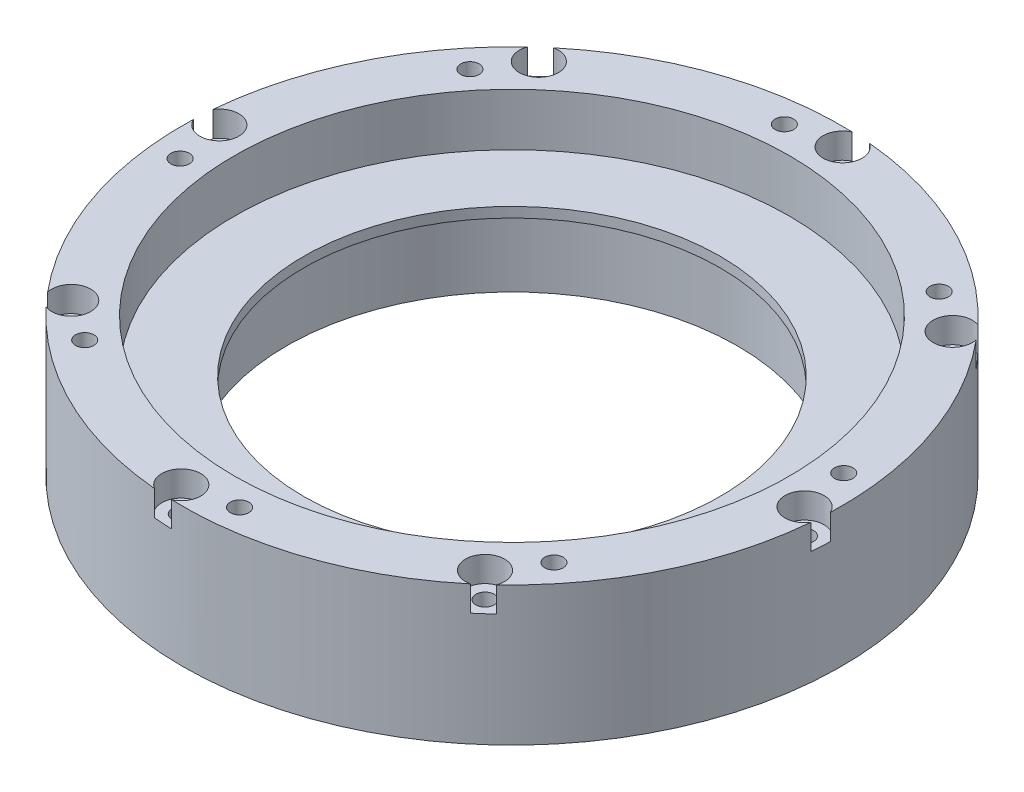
ISO-10303-21;
HEADER;
FILE_DESCRIPTION(('STEP AP214'),'2;1');
FILE_NAME('part.step','',(''),(''),'','','');
FILE_SCHEMA(('AUTOMOTIVE_DESIGN { 1 0 10303 214 1 1 1 1 }'));
ENDSEC;
DATA;
#1=APPLICATION_CONTEXT('core data for automotive mechanical design processes');
#2=APPLICATION_PROTOCOL_DEFINITION('international standard','automotive_design',2000,#1);
#3=PRODUCT_CONTEXT('',#1,'mechanical');
#4=PRODUCT('Part','Part','',(#3));
#5=PRODUCT_RELATED_PRODUCT_CATEGORY('part','',(#4));
#6=PRODUCT_DEFINITION_FORMATION('','',#4);
#7=PRODUCT_DEFINITION_CONTEXT('part definition',#1,'design');
#8=PRODUCT_DEFINITION('design','',#6,#7);
#9=PRODUCT_DEFINITION_SHAPE('','',#8);
#10=(LENGTH_UNIT() NAMED_UNIT(*) SI_UNIT(.MILLI.,.METRE.));
#11=(NAMED_UNIT(*) PLANE_ANGLE_UNIT() SI_UNIT($,.RADIAN.));
#12=(NAMED_UNIT(*) SI_UNIT($,.STERADIAN.) SOLID_ANGLE_UNIT());
#13=UNCERTAINTY_MEASURE_WITH_UNIT(LENGTH_MEASURE(1.E-05),#10,'distance_accuracy_value','');
#14=(GEOMETRIC_REPRESENTATION_CONTEXT(3) GLOBAL_UNCERTAINTY_ASSIGNED_CONTEXT((#13)) GLOBAL_UNIT_ASSIGNED_CONTEXT((#10,
#11,#12)) REPRESENTATION_CONTEXT('',''));
#15=CARTESIAN_POINT('',(0.,0.,0.));
#16=DIRECTION('',(0.,0.,1.));
#17=DIRECTION('',(1.,0.,0.));
#18=AXIS2_PLACEMENT_3D('',#15,#16,#17);
#19=CARTESIAN_POINT('',(0.,50.8,0.));
#20=DIRECTION('',(0.,-1.,0.));
#21=DIRECTION('',(0.,0.,-1.));
#22=AXIS2_PLACEMENT_3D('',#19,#20,#21);
#23=CYLINDRICAL_SURFACE('',#22,120.65);
#24=CARTESIAN_POINT('',(0.,41.529,0.));
#25=DIRECTION('',(0.,-1.,0.));
#26=DIRECTION('',(0.,0.,-1.));
#27=AXIS2_PLACEMENT_3D('',#24,#25,#26);
#28=CIRCLE('',#27,120.65);
#29=CARTESIAN_POINT('',(-3.99453492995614,41.529,120.583855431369));
#30=VERTEX_POINT('',#29);
#31=CARTESIAN_POINT('',(-10.7061722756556,41.529,120.174042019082));
#32=VERTEX_POINT('',#31);
#33=EDGE_CURVE('E405',#30,#32,#28,.T.);
#34=ORIENTED_EDGE('',*,*,#33,.T.);
#35=DIRECTION('',(0.,1.,0.));
#36=VECTOR('',#35,1.);
#37=CARTESIAN_POINT('',(-10.7061722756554,46.1645,120.174042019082));
#38=LINE('',#37,#36);
#39=CARTESIAN_POINT('',(-10.7061722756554,50.8,120.174042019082));
#40=VERTEX_POINT('',#39);
#41=EDGE_CURVE('E11',#32,#40,#38,.T.);
#42=ORIENTED_EDGE('',*,*,#41,.T.);
#43=CARTESIAN_POINT('',(0.,50.8,0.));
#44=DIRECTION('',(0.,1.,0.));
#45=DIRECTION('',(0.,0.,1.));
#46=AXIS2_PLACEMENT_3D('',#43,#44,#45);
#47=CIRCLE('',#46,120.65);
#48=CARTESIAN_POINT('',(-88.0902246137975,50.8,82.4410991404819));
#49=VERTEX_POINT('',#48);
#50=EDGE_CURVE('E421',#49,#40,#47,.T.);
#51=ORIENTED_EDGE('',*,*,#50,.F.);
#52=DIRECTION('',(0.,1.,0.));
#53=VECTOR('',#52,1.);
#54=CARTESIAN_POINT('',(-88.0902246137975,46.1645,82.4410991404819));
#55=LINE('',#54,#53);
#56=CARTESIAN_POINT('',(-88.090224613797,41.529,82.441099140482));
#57=VERTEX_POINT('',#56);
#58=EDGE_CURVE('E390',#49,#57,#55,.F.);
#59=ORIENTED_EDGE('',*,*,#58,.T.);
#60=CARTESIAN_POINT('',(0.,41.529,0.));
#61=DIRECTION('',(0.,-1.,0.));
#62=DIRECTION('',(0.,0.,-1.));
#63=AXIS2_PLACEMENT_3D('',#60,#61,#62);
#64=CIRCLE('',#63,120.65);
#65=CARTESIAN_POINT('',(-92.5462870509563,41.529,77.4054730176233));
#66=VERTEX_POINT('',#65);
#67=EDGE_CURVE('E387',#57,#66,#64,.T.);
#68=ORIENTED_EDGE('',*,*,#67,.T.);
#69=DIRECTION('',(0.,1.,0.));
#70=VECTOR('',#69,1.);
#71=CARTESIAN_POINT('',(-92.5462870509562,46.1645,77.4054730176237));
#72=LINE('',#71,#70);
#73=CARTESIAN_POINT('',(-92.5462870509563,50.8,77.4054730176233));
#74=VERTEX_POINT('',#73);
#75=EDGE_CURVE('E393',#66,#74,#72,.T.);
#76=ORIENTED_EDGE('',*,*,#75,.T.);
#77=CARTESIAN_POINT('',(-120.583855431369,50.8,-3.99453492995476));
#78=VERTEX_POINT('',#77);
#79=EDGE_CURVE('E423',#78,#74,#47,.T.);
#80=ORIENTED_EDGE('',*,*,#79,.F.);
#81=DIRECTION('',(0.,1.,0.));
#82=VECTOR('',#81,1.);
#83=CARTESIAN_POINT('',(-120.583855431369,46.1645,-3.99453492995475));
#84=LINE('',#83,#82);
#85=CARTESIAN_POINT('',(-120.583855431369,41.529,-3.99453492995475));
#86=VERTEX_POINT('',#85);
#87=EDGE_CURVE('E378',#78,#86,#84,.F.);
#88=ORIENTED_EDGE('',*,*,#87,.T.);
#89=CARTESIAN_POINT('',(0.,41.529,0.));
#90=DIRECTION('',(0.,-1.,0.));
#91=DIRECTION('',(0.,0.,-1.));
#92=AXIS2_PLACEMENT_3D('',#89,#90,#91);
#93=CIRCLE('',#92,120.65);
#94=CARTESIAN_POINT('',(-120.174042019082,41.529,-10.7061722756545));
#95=VERTEX_POINT('',#94);
#96=EDGE_CURVE('E381',#86,#95,#93,.T.);
#97=ORIENTED_EDGE('',*,*,#96,.T.);
#98=DIRECTION('',(0.,1.,0.));
#99=VECTOR('',#98,1.);
#100=CARTESIAN_POINT('',(-120.174042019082,46.1645,-10.7061722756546));
#101=LINE('',#100,#99);
#102=CARTESIAN_POINT('',(-120.174042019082,50.8,-10.7061722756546));
#103=VERTEX_POINT('',#102);
#104=EDGE_CURVE('E384',#95,#103,#101,.T.);
#105=ORIENTED_EDGE('',*,*,#104,.T.);
#106=CARTESIAN_POINT('',(-82.4410991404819,50.8,-88.0902246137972));
#107=VERTEX_POINT('',#106);
#108=EDGE_CURVE('E424',#107,#103,#47,.T.);
#109=ORIENTED_EDGE('',*,*,#108,.F.);
#110=DIRECTION('',(0.,1.,0.));
#111=VECTOR('',#110,1.);
#112=CARTESIAN_POINT('',(-82.4410991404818,46.1645,-88.0902246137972));
#113=LINE('',#112,#111);
#114=CARTESIAN_POINT('',(-82.4410991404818,41.529,-88.0902246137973));
#115=VERTEX_POINT('',#114);
#116=EDGE_CURVE('E372',#107,#115,#113,.F.);
#117=ORIENTED_EDGE('',*,*,#116,.T.);
#118=CARTESIAN_POINT('',(0.,41.529,0.));
#119=DIRECTION('',(0.,-1.,0.));
#120=DIRECTION('',(0.,0.,-1.));
#121=AXIS2_PLACEMENT_3D('',#118,#119,#120);
#122=CIRCLE('',#121,120.65);
#123=CARTESIAN_POINT('',(-77.4054730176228,41.529,-92.5462870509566));
#124=VERTEX_POINT('',#123);
#125=EDGE_CURVE('E273',#115,#124,#122,.T.);
#126=ORIENTED_EDGE('',*,*,#125,.T.);
#127=DIRECTION('',(0.,1.,0.));
#128=VECTOR('',#127,1.);
#129=CARTESIAN_POINT('',(-77.4054730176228,46.1645,-92.5462870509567));
#130=LINE('',#129,#128);
#131=CARTESIAN_POINT('',(-77.4054730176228,50.8,-92.5462870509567));
#132=VERTEX_POINT('',#131);
#133=EDGE_CURVE('E375',#124,#132,#130,.T.);
#134=ORIENTED_EDGE('',*,*,#133,.T.);
#135=CARTESIAN_POINT('',(3.99453492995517,50.8,-120.583855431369));
#136=VERTEX_POINT('',#135);
#137=EDGE_CURVE('E565',#136,#132,#47,.T.);
#138=ORIENTED_EDGE('',*,*,#137,.F.);
#139=DIRECTION('',(0.,1.,0.));
#140=VECTOR('',#139,1.);
#141=CARTESIAN_POINT('',(3.99453492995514,46.1645,-120.583855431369));
#142=LINE('',#141,#140);
#143=CARTESIAN_POINT('',(3.99453492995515,41.529,-120.583855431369));
#144=VERTEX_POINT('',#143);
#145=EDGE_CURVE('E362',#136,#144,#142,.F.);
#146=ORIENTED_EDGE('',*,*,#145,.T.);
#147=CARTESIAN_POINT('',(0.,41.529,0.));
#148=DIRECTION('',(0.,-1.,0.));
#149=DIRECTION('',(0.,0.,-1.));
#150=AXIS2_PLACEMENT_3D('',#147,#148,#149);
#151=CIRCLE('',#150,120.65);
#152=CARTESIAN_POINT('',(10.706172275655,41.529,-120.174042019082));
#153=VERTEX_POINT('',#152);
#154=EDGE_CURVE('E365',#144,#153,#151,.T.);
#155=ORIENTED_EDGE('',*,*,#154,.T.);
#156=DIRECTION('',(0.,1.,0.));
#157=VECTOR('',#156,1.);
#158=CARTESIAN_POINT('',(10.7061722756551,46.1645,-120.174042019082));
#159=LINE('',#158,#157);
#160=CARTESIAN_POINT('',(10.706172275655,50.8,-120.174042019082));
#161=VERTEX_POINT('',#160);
#162=EDGE_CURVE('E274',#153,#161,#159,.T.);
#163=ORIENTED_EDGE('',*,*,#162,.T.);
#164=CARTESIAN_POINT('',(88.0902246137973,50.8,-82.4410991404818));
#165=VERTEX_POINT('',#164);
#166=EDGE_CURVE('E346',#165,#161,#47,.T.);
#167=ORIENTED_EDGE('',*,*,#166,.F.);
#168=DIRECTION('',(0.,1.,0.));
#169=VECTOR('',#168,1.);
#170=CARTESIAN_POINT('',(88.0902246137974,46.1645,-82.441099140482));
#171=LINE('',#170,#169);
#172=CARTESIAN_POINT('',(88.0902246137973,41.529,-82.441099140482));
#173=VERTEX_POINT('',#172);
#174=EDGE_CURVE('E307',#165,#173,#171,.F.);
#175=ORIENTED_EDGE('',*,*,#174,.T.);
#176=CARTESIAN_POINT('',(0.,41.529,0.));
#177=DIRECTION('',(0.,-1.,0.));
#178=DIRECTION('',(0.,0.,-1.));
#179=AXIS2_PLACEMENT_3D('',#176,#177,#178);
#180=CIRCLE('',#179,120.65);
#181=CARTESIAN_POINT('',(92.5462870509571,41.529,-77.4054730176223));
#182=VERTEX_POINT('',#181);
#183=EDGE_CURVE('E297',#173,#182,#180,.T.);
#184=ORIENTED_EDGE('',*,*,#183,.T.);
#185=DIRECTION('',(0.,1.,0.));
#186=VECTOR('',#185,1.);
#187=CARTESIAN_POINT('',(92.546287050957,46.1645,-77.4054730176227));
#188=LINE('',#187,#186);
#189=CARTESIAN_POINT('',(92.546287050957,50.8,-77.4054730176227));
#190=VERTEX_POINT('',#189);
#191=EDGE_CURVE('E310',#182,#190,#188,.T.);
#192=ORIENTED_EDGE('',*,*,#191,.T.);
#193=CARTESIAN_POINT('',(120.583855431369,50.8,3.99453492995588));
#194=VERTEX_POINT('',#193);
#195=EDGE_CURVE('E342',#194,#190,#47,.T.);
#196=ORIENTED_EDGE('',*,*,#195,.F.);
#197=DIRECTION('',(0.,1.,0.));
#198=VECTOR('',#197,1.);
#199=CARTESIAN_POINT('',(120.583855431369,46.1645,3.99453492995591));
#200=LINE('',#199,#198);
#201=CARTESIAN_POINT('',(120.583855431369,41.529,3.99453492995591));
#202=VERTEX_POINT('',#201);
#203=EDGE_CURVE('E345',#194,#202,#200,.F.);
#204=ORIENTED_EDGE('',*,*,#203,.T.);
#205=CARTESIAN_POINT('',(0.,41.529,0.));
#206=DIRECTION('',(0.,-1.,0.));
#207=DIRECTION('',(0.,0.,-1.));
#208=AXIS2_PLACEMENT_3D('',#205,#206,#207);
#209=CIRCLE('',#208,120.65);
#210=CARTESIAN_POINT('',(120.174042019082,41.529,10.7061722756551));
#211=VERTEX_POINT('',#210);
#212=EDGE_CURVE('E355',#202,#211,#209,.T.);
#213=ORIENTED_EDGE('',*,*,#212,.T.);
#214=DIRECTION('',(0.,1.,0.));
#215=VECTOR('',#214,1.);
#216=CARTESIAN_POINT('',(120.174042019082,46.1645,10.706172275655));
#217=LINE('',#216,#215);
#218=CARTESIAN_POINT('',(120.174042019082,50.8,10.706172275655));
#219=VERTEX_POINT('',#218);
#220=EDGE_CURVE('E298',#211,#219,#217,.T.);
#221=ORIENTED_EDGE('',*,*,#220,.T.);
#222=CARTESIAN_POINT('',(82.4410991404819,50.8,88.0902246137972));
#223=VERTEX_POINT('',#222);
#224=EDGE_CURVE('E350',#223,#219,#47,.T.);
#225=ORIENTED_EDGE('',*,*,#224,.F.);
#226=DIRECTION('',(0.,1.,0.));
#227=VECTOR('',#226,1.);
#228=CARTESIAN_POINT('',(82.4410991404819,46.1645,88.0902246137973));
#229=LINE('',#228,#227);
#230=CARTESIAN_POINT('',(82.4410991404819,41.529,88.0902246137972));
#231=VERTEX_POINT('',#230);
#232=EDGE_CURVE('E399',#223,#231,#229,.F.);
#233=ORIENTED_EDGE('',*,*,#232,.T.);
#234=CARTESIAN_POINT('',(0.,41.529,0.));
#235=DIRECTION('',(0.,-1.,0.));
#236=DIRECTION('',(0.,0.,-1.));
#237=AXIS2_PLACEMENT_3D('',#234,#235,#236);
#238=CIRCLE('',#237,120.65);
#239=CARTESIAN_POINT('',(77.4054730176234,41.529,92.5462870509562));
#240=VERTEX_POINT('',#239);
#241=EDGE_CURVE('E396',#231,#240,#238,.T.);
#242=ORIENTED_EDGE('',*,*,#241,.T.);
#243=DIRECTION('',(0.,1.,0.));
#244=VECTOR('',#243,1.);
#245=CARTESIAN_POINT('',(77.4054730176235,46.1645,92.5462870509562));
#246=LINE('',#245,#244);
#247=CARTESIAN_POINT('',(77.4054730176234,50.8,92.5462870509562));
#248=VERTEX_POINT('',#247);
#249=EDGE_CURVE('E402',#240,#248,#246,.T.);
#250=ORIENTED_EDGE('',*,*,#249,.T.);
#251=CARTESIAN_POINT('',(-3.99453492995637,50.8,120.583855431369));
#252=VERTEX_POINT('',#251);
#253=EDGE_CURVE('E347',#252,#248,#47,.T.);
#254=ORIENTED_EDGE('',*,*,#253,.F.);
#255=DIRECTION('',(0.,1.,0.));
#256=VECTOR('',#255,1.);
#257=CARTESIAN_POINT('',(-3.99453492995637,46.1645,120.583855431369));
#258=LINE('',#257,#256);
#259=EDGE_CURVE('E46',#252,#30,#258,.F.);
#260=ORIENTED_EDGE('',*,*,#259,.T.);
#261=EDGE_LOOP('',(#34,#42,#51,#59,#68,#76,#80,#88,#97,#105,#109,#117,#126,#134,#138,#146,#155,
#163,#167,#175,#184,#192,#196,#204,#213,#221,#225,#233,#242,#250,#254,#260));
#262=FACE_BOUND('',#261,.T.);
#263=CARTESIAN_POINT('',(0.,0.,0.));
#264=DIRECTION('',(0.,1.,0.));
#265=DIRECTION('',(0.,0.,1.));
#266=AXIS2_PLACEMENT_3D('',#263,#264,#265);
#267=CIRCLE('',#266,120.65);
#268=CARTESIAN_POINT('',(0.,0.,120.65));
#269=VERTEX_POINT('',#268);
#270=EDGE_CURVE('E339',#269,#269,#267,.T.);
#271=ORIENTED_EDGE('',*,*,#270,.T.);
#272=EDGE_LOOP('',(#271));
#273=FACE_BOUND('',#272,.T.);
#274=ADVANCED_FACE('F39',(#262,#273),#23,.T.);
#275=CARTESIAN_POINT('',(0.,50.8,0.));
#276=DIRECTION('',(0.,1.,0.));
#277=DIRECTION('',(0.,0.,1.));
#278=AXIS2_PLACEMENT_3D('',#275,#276,#277);
#279=PLANE('',#278);
#280=CARTESIAN_POINT('',(85.8904862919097,50.8,70.50950283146));
#281=DIRECTION('',(0.,1.,0.));
#282=DIRECTION('',(0.,0.,1.));
#283=AXIS2_PLACEMENT_3D('',#280,#281,#282);
#284=CIRCLE('',#283,3.37819999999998);
#285=CARTESIAN_POINT('',(85.8904862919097,50.8,73.88770283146));
#286=VERTEX_POINT('',#285);
#287=EDGE_CURVE('E184',#286,#286,#284,.T.);
#288=ORIENTED_EDGE('',*,*,#287,.F.);
#289=EDGE_LOOP('',(#288));
#290=FACE_BOUND('',#289,.T.);
#291=CARTESIAN_POINT('',(10.8759977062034,50.8,110.59149288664));
#292=DIRECTION('',(0.,1.,0.));
#293=DIRECTION('',(0.,0.,1.));
#294=AXIS2_PLACEMENT_3D('',#291,#292,#293);
#295=CIRCLE('',#294,3.37819999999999);
#296=CARTESIAN_POINT('',(10.8759977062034,50.8,113.96969288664));
#297=VERTEX_POINT('',#296);
#298=EDGE_CURVE('E183',#297,#297,#295,.T.);
#299=ORIENTED_EDGE('',*,*,#298,.F.);
#300=EDGE_LOOP('',(#299));
#301=FACE_BOUND('',#300,.T.);
#302=CARTESIAN_POINT('',(-70.509503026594,50.8,85.890486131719));
#303=DIRECTION('',(0.,1.,0.));
#304=DIRECTION('',(0.,0.,1.));
#305=AXIS2_PLACEMENT_3D('',#302,#303,#304);
#306=CIRCLE('',#305,3.37819999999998);
#307=CARTESIAN_POINT('',(-70.509503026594,50.8,89.268686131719));
#308=VERTEX_POINT('',#307);
#309=EDGE_CURVE('E194',#308,#308,#306,.T.);
#310=ORIENTED_EDGE('',*,*,#309,.F.);
#311=EDGE_LOOP('',(#310));
#312=FACE_BOUND('',#311,.T.);
#313=CARTESIAN_POINT('',(-110.591492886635,50.8,10.875997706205));
#314=DIRECTION('',(0.,1.,0.));
#315=DIRECTION('',(0.,0.,1.));
#316=AXIS2_PLACEMENT_3D('',#313,#314,#315);
#317=CIRCLE('',#316,3.37819999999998);
#318=CARTESIAN_POINT('',(-110.591492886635,50.8,14.254197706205));
#319=VERTEX_POINT('',#318);
#320=EDGE_CURVE('E200',#319,#319,#317,.T.);
#321=ORIENTED_EDGE('',*,*,#320,.F.);
#322=EDGE_LOOP('',(#321));
#323=FACE_BOUND('',#322,.T.);
#324=CARTESIAN_POINT('',(-85.8904862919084,50.8,-70.5095028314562));
#325=DIRECTION('',(0.,1.,0.));
#326=DIRECTION('',(0.,0.,1.));
#327=AXIS2_PLACEMENT_3D('',#324,#325,#326);
#328=CIRCLE('',#327,3.37819999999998);
#329=CARTESIAN_POINT('',(-85.8904862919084,50.8,-67.1313028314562));
#330=VERTEX_POINT('',#329);
#331=EDGE_CURVE('E206',#330,#330,#328,.T.);
#332=ORIENTED_EDGE('',*,*,#331,.F.);
#333=EDGE_LOOP('',(#332));
#334=FACE_BOUND('',#333,.T.);
#335=CARTESIAN_POINT('',(-10.8759977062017,50.8,-110.591492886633));
#336=DIRECTION('',(0.,1.,0.));
#337=DIRECTION('',(0.,0.,1.));
#338=AXIS2_PLACEMENT_3D('',#335,#336,#337);
#339=CIRCLE('',#338,3.37819999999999);
#340=CARTESIAN_POINT('',(-10.8759977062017,50.8,-107.213292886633));
#341=VERTEX_POINT('',#340);
#342=EDGE_CURVE('E212',#341,#341,#339,.T.);
#343=ORIENTED_EDGE('',*,*,#342,.F.);
#344=EDGE_LOOP('',(#343));
#345=FACE_BOUND('',#344,.T.);
#346=CARTESIAN_POINT('',(70.5095028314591,50.8,-85.8904862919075));
#347=DIRECTION('',(0.,1.,0.));
#348=DIRECTION('',(0.,0.,1.));
#349=AXIS2_PLACEMENT_3D('',#346,#347,#348);
#350=CIRCLE('',#349,3.37819999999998);
#351=CARTESIAN_POINT('',(70.5095028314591,50.8,-82.5122862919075));
#352=VERTEX_POINT('',#351);
#353=EDGE_CURVE('E218',#352,#352,#350,.T.);
#354=ORIENTED_EDGE('',*,*,#353,.F.);
#355=EDGE_LOOP('',(#354));
#356=FACE_BOUND('',#355,.T.);
#357=CARTESIAN_POINT('',(110.591492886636,50.8,-10.8759977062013));
#358=DIRECTION('',(0.,1.,0.));
#359=DIRECTION('',(0.,0.,1.));
#360=AXIS2_PLACEMENT_3D('',#357,#358,#359);
#361=CIRCLE('',#360,3.37819999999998);
#362=CARTESIAN_POINT('',(110.591492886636,50.8,-7.49779770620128));
#363=VERTEX_POINT('',#362);
#364=EDGE_CURVE('E224',#363,#363,#361,.T.);
#365=ORIENTED_EDGE('',*,*,#364,.F.);
#366=EDGE_LOOP('',(#365));
#367=FACE_BOUND('',#366,.T.);
#368=CARTESIAN_POINT('',(-6.96619814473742,50.8,114.087519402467));
#369=DIRECTION('',(0.,1.,0.));
#370=DIRECTION('',(0.,0.,1.));
#371=AXIS2_PLACEMENT_3D('',#368,#369,#370);
#372=CIRCLE('',#371,7.14375);
#373=EDGE_CURVE('E230',#252,#40,#372,.T.);
#374=ORIENTED_EDGE('',*,*,#373,.F.);
#375=ORIENTED_EDGE('',*,*,#253,.T.);
#376=CARTESIAN_POINT('',(75.7462126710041,50.8,85.5979045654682));
#377=DIRECTION('',(0.,1.,0.));
#378=DIRECTION('',(0.,0.,1.));
#379=AXIS2_PLACEMENT_3D('',#376,#377,#378);
#380=CIRCLE('',#379,7.14375);
#381=EDGE_CURVE('E239',#223,#248,#380,.T.);
#382=ORIENTED_EDGE('',*,*,#381,.F.);
#383=ORIENTED_EDGE('',*,*,#224,.T.);
#384=CARTESIAN_POINT('',(114.087519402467,50.8,6.96619814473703));
#385=DIRECTION('',(0.,1.,0.));
#386=DIRECTION('',(0.,0.,1.));
#387=AXIS2_PLACEMENT_3D('',#384,#385,#386);
#388=CIRCLE('',#387,7.14375);
#389=EDGE_CURVE('E313',#194,#219,#388,.T.);
#390=ORIENTED_EDGE('',*,*,#389,.F.);
#391=ORIENTED_EDGE('',*,*,#195,.T.);
#392=CARTESIAN_POINT('',(85.5979045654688,50.8,-75.746212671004));
#393=DIRECTION('',(0.,1.,0.));
#394=DIRECTION('',(0.,0.,1.));
#395=AXIS2_PLACEMENT_3D('',#392,#393,#394);
#396=CIRCLE('',#395,7.14375);
#397=EDGE_CURVE('E295',#165,#190,#396,.T.);
#398=ORIENTED_EDGE('',*,*,#397,.F.);
#399=ORIENTED_EDGE('',*,*,#166,.T.);
#400=CARTESIAN_POINT('',(6.96619814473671,50.8,-114.087519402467));
#401=DIRECTION('',(0.,1.,0.));
#402=DIRECTION('',(0.,0.,1.));
#403=AXIS2_PLACEMENT_3D('',#400,#401,#402);
#404=CIRCLE('',#403,7.14375);
#405=EDGE_CURVE('E283',#136,#161,#404,.T.);
#406=ORIENTED_EDGE('',*,*,#405,.F.);
#407=ORIENTED_EDGE('',*,*,#137,.T.);
#408=CARTESIAN_POINT('',(-75.7462126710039,50.8,-85.5979045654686));
#409=DIRECTION('',(0.,1.,0.));
#410=DIRECTION('',(0.,0.,1.));
#411=AXIS2_PLACEMENT_3D('',#408,#409,#410);
#412=CIRCLE('',#411,7.14375);
#413=EDGE_CURVE('E271',#107,#132,#412,.T.);
#414=ORIENTED_EDGE('',*,*,#413,.F.);
#415=ORIENTED_EDGE('',*,*,#108,.T.);
#416=CARTESIAN_POINT('',(-114.087519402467,50.8,-6.96619814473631));
#417=DIRECTION('',(0.,1.,0.));
#418=DIRECTION('',(0.,0.,1.));
#419=AXIS2_PLACEMENT_3D('',#416,#417,#418);
#420=CIRCLE('',#419,7.14375);
#421=EDGE_CURVE('E259',#78,#103,#420,.T.);
#422=ORIENTED_EDGE('',*,*,#421,.F.);
#423=ORIENTED_EDGE('',*,*,#79,.T.);
#424=CARTESIAN_POINT('',(-85.5979045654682,50.8,75.7462126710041));
#425=DIRECTION('',(0.,1.,0.));
#426=DIRECTION('',(0.,0.,1.));
#427=AXIS2_PLACEMENT_3D('',#424,#425,#426);
#428=CIRCLE('',#427,7.14375);
#429=EDGE_CURVE('E249',#49,#74,#428,.T.);
#430=ORIENTED_EDGE('',*,*,#429,.F.);
#431=ORIENTED_EDGE('',*,*,#50,.T.);
#432=EDGE_LOOP('',(#374,#375,#382,#383,#390,#391,#398,#399,#406,#407,#414,#415,#422,#423,#430,#431));
#433=FACE_BOUND('',#432,.T.);
#434=CARTESIAN_POINT('',(0.,50.8,0.));
#435=DIRECTION('',(0.,1.,0.));
#436=DIRECTION('',(0.,0.,1.));
#437=AXIS2_PLACEMENT_3D('',#434,#435,#436);
#438=CIRCLE('',#437,101.6);
#439=CARTESIAN_POINT('',(0.,50.8,101.6));
#440=VERTEX_POINT('',#439);
#441=EDGE_CURVE('E332',#440,#440,#438,.T.);
#442=ORIENTED_EDGE('',*,*,#441,.F.);
#443=EDGE_LOOP('',(#442));
#444=FACE_BOUND('',#443,.T.);
#445=ADVANCED_FACE('F416',(#290,#301,#312,#323,#334,#345,#356,#367,#433,#444),#279,.T.);
#446=CARTESIAN_POINT('',(0.,0.,0.));
#447=DIRECTION('',(0.,1.,0.));
#448=DIRECTION('',(0.,0.,1.));
#449=AXIS2_PLACEMENT_3D('',#446,#447,#448);
#450=PLANE('',#449);
#451=CARTESIAN_POINT('',(-6.96619814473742,0.,114.087519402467));
#452=DIRECTION('',(0.,1.,0.));
#453=DIRECTION('',(0.,0.,1.));
#454=AXIS2_PLACEMENT_3D('',#451,#452,#453);
#455=CIRCLE('',#454,3.37819999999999);
#456=CARTESIAN_POINT('',(-6.96619814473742,0.,117.465719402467));
#457=VERTEX_POINT('',#456);
#458=EDGE_CURVE('E236',#457,#457,#455,.T.);
#459=ORIENTED_EDGE('',*,*,#458,.T.);
#460=EDGE_LOOP('',(#459));
#461=FACE_BOUND('',#460,.T.);
#462=CARTESIAN_POINT('',(75.7462126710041,0.,85.5979045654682));
#463=DIRECTION('',(0.,1.,0.));
#464=DIRECTION('',(0.,0.,1.));
#465=AXIS2_PLACEMENT_3D('',#462,#463,#464);
#466=CIRCLE('',#465,3.37819999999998);
#467=CARTESIAN_POINT('',(75.7462126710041,0.,88.9761045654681));
#468=VERTEX_POINT('',#467);
#469=EDGE_CURVE('E246',#468,#468,#466,.T.);
#470=ORIENTED_EDGE('',*,*,#469,.T.);
#471=EDGE_LOOP('',(#470));
#472=FACE_BOUND('',#471,.T.);
#473=CARTESIAN_POINT('',(-85.5979045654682,0.,75.7462126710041));
#474=DIRECTION('',(0.,1.,0.));
#475=DIRECTION('',(0.,0.,1.));
#476=AXIS2_PLACEMENT_3D('',#473,#474,#475);
#477=CIRCLE('',#476,3.37819999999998);
#478=CARTESIAN_POINT('',(-85.5979045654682,0.,79.1244126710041));
#479=VERTEX_POINT('',#478);
#480=EDGE_CURVE('E256',#479,#479,#477,.T.);
#481=ORIENTED_EDGE('',*,*,#480,.T.);
#482=EDGE_LOOP('',(#481));
#483=FACE_BOUND('',#482,.T.);
#484=CARTESIAN_POINT('',(-114.087519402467,0.,-6.96619814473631));
#485=DIRECTION('',(0.,1.,0.));
#486=DIRECTION('',(0.,0.,1.));
#487=AXIS2_PLACEMENT_3D('',#484,#485,#486);
#488=CIRCLE('',#487,3.37819999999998);
#489=CARTESIAN_POINT('',(-114.087519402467,0.,-3.58799814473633));
#490=VERTEX_POINT('',#489);
#491=EDGE_CURVE('E267',#490,#490,#488,.T.);
#492=ORIENTED_EDGE('',*,*,#491,.T.);
#493=EDGE_LOOP('',(#492));
#494=FACE_BOUND('',#493,.T.);
#495=CARTESIAN_POINT('',(-75.7462126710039,0.,-85.5979045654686));
#496=DIRECTION('',(0.,1.,0.));
#497=DIRECTION('',(0.,0.,1.));
#498=AXIS2_PLACEMENT_3D('',#495,#496,#497);
#499=CIRCLE('',#498,3.37819999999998);
#500=CARTESIAN_POINT('',(-75.7462126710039,0.,-82.2197045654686));
#501=VERTEX_POINT('',#500);
#502=EDGE_CURVE('E280',#501,#501,#499,.T.);
#503=ORIENTED_EDGE('',*,*,#502,.T.);
#504=EDGE_LOOP('',(#503));
#505=FACE_BOUND('',#504,.T.);
#506=CARTESIAN_POINT('',(6.96619814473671,0.,-114.087519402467));
#507=DIRECTION('',(0.,1.,0.));
#508=DIRECTION('',(0.,0.,1.));
#509=AXIS2_PLACEMENT_3D('',#506,#507,#508);
#510=CIRCLE('',#509,3.37819999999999);
#511=CARTESIAN_POINT('',(6.96619814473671,0.,-110.709319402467));
#512=VERTEX_POINT('',#511);
#513=EDGE_CURVE('E291',#512,#512,#510,.T.);
#514=ORIENTED_EDGE('',*,*,#513,.T.);
#515=EDGE_LOOP('',(#514));
#516=FACE_BOUND('',#515,.T.);
#517=CARTESIAN_POINT('',(85.5979045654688,0.,-75.746212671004));
#518=DIRECTION('',(0.,1.,0.));
#519=DIRECTION('',(0.,0.,1.));
#520=AXIS2_PLACEMENT_3D('',#517,#518,#519);
#521=CIRCLE('',#520,3.37819999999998);
#522=CARTESIAN_POINT('',(85.5979045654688,0.,-72.368012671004));
#523=VERTEX_POINT('',#522);
#524=EDGE_CURVE('E304',#523,#523,#521,.T.);
#525=ORIENTED_EDGE('',*,*,#524,.T.);
#526=EDGE_LOOP('',(#525));
#527=FACE_BOUND('',#526,.T.);
#528=CARTESIAN_POINT('',(114.087519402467,0.,6.96619814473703));
#529=DIRECTION('',(0.,1.,0.));
#530=DIRECTION('',(0.,0.,1.));
#531=AXIS2_PLACEMENT_3D('',#528,#529,#530);
#532=CIRCLE('',#531,3.37819999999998);
#533=CARTESIAN_POINT('',(114.087519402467,0.,10.344398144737));
#534=VERTEX_POINT('',#533);
#535=EDGE_CURVE('E322',#534,#534,#532,.T.);
#536=ORIENTED_EDGE('',*,*,#535,.T.);
#537=EDGE_LOOP('',(#536));
#538=FACE_BOUND('',#537,.T.);
#539=CARTESIAN_POINT('',(0.,0.,0.));
#540=DIRECTION('',(0.,-1.,0.));
#541=DIRECTION('',(0.,0.,-1.));
#542=AXIS2_PLACEMENT_3D('',#539,#540,#541);
#543=CIRCLE('',#542,82.55);
#544=CARTESIAN_POINT('',(0.,0.,-82.55));
#545=VERTEX_POINT('',#544);
#546=EDGE_CURVE('E333',#545,#545,#543,.T.);
#547=ORIENTED_EDGE('',*,*,#546,.F.);
#548=EDGE_LOOP('',(#547));
#549=FACE_BOUND('',#548,.T.);
#550=ORIENTED_EDGE('',*,*,#270,.F.);
#551=EDGE_LOOP('',(#550));
#552=FACE_BOUND('',#551,.T.);
#553=ADVANCED_FACE('F452',(#461,#472,#483,#494,#505,#516,#527,#538,#549,#552),#450,.F.);
#554=CARTESIAN_POINT('',(0.,31.623,0.));
#555=DIRECTION('',(0.,1.,0.));
#556=DIRECTION('',(0.,0.,1.));
#557=AXIS2_PLACEMENT_3D('',#554,#555,#556);
#558=CYLINDRICAL_SURFACE('',#557,101.6);
#559=CARTESIAN_POINT('',(0.,31.623,0.));
#560=DIRECTION('',(0.,1.,0.));
#561=DIRECTION('',(0.,0.,1.));
#562=AXIS2_PLACEMENT_3D('',#559,#560,#561);
#563=CIRCLE('',#562,101.6);
#564=CARTESIAN_POINT('',(0.,31.623,101.6));
#565=VERTEX_POINT('',#564);
#566=EDGE_CURVE('E336',#565,#565,#563,.T.);
#567=CARTESIAN_POINT('',(0.,31.623,101.6));
#568=CARTESIAN_POINT('',(0.,31.8227604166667,101.6));
#569=CARTESIAN_POINT('',(0.,32.0225208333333,101.6));
#570=CARTESIAN_POINT('',(0.,32.4220416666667,101.6));
#571=CARTESIAN_POINT('',(0.,32.6218020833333,101.6));
#572=CARTESIAN_POINT('',(0.,33.0213229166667,101.6));
#573=CARTESIAN_POINT('',(0.,33.2210833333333,101.6));
#574=CARTESIAN_POINT('',(0.,33.6206041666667,101.6));
#575=CARTESIAN_POINT('',(0.,33.8203645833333,101.6));
#576=CARTESIAN_POINT('',(0.,34.2198854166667,101.6));
#577=CARTESIAN_POINT('',(0.,34.4196458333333,101.6));
#578=CARTESIAN_POINT('',(0.,34.8191666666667,101.6));
#579=CARTESIAN_POINT('',(0.,35.0189270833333,101.6));
#580=CARTESIAN_POINT('',(0.,35.4184479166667,101.6));
#581=CARTESIAN_POINT('',(0.,35.6182083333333,101.6));
#582=CARTESIAN_POINT('',(0.,36.0177291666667,101.6));
#583=CARTESIAN_POINT('',(0.,36.2174895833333,101.6));
#584=CARTESIAN_POINT('',(0.,36.6170104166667,101.6));
#585=CARTESIAN_POINT('',(0.,36.8167708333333,101.6));
#586=CARTESIAN_POINT('',(0.,37.2162916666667,101.6));
#587=CARTESIAN_POINT('',(0.,37.4160520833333,101.6));
#588=CARTESIAN_POINT('',(0.,37.8155729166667,101.6));
#589=CARTESIAN_POINT('',(0.,38.0153333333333,101.6));
#590=CARTESIAN_POINT('',(0.,38.4148541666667,101.6));
#591=CARTESIAN_POINT('',(0.,38.6146145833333,101.6));
#592=CARTESIAN_POINT('',(0.,39.0141354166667,101.6));
#593=CARTESIAN_POINT('',(0.,39.2138958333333,101.6));
#594=CARTESIAN_POINT('',(0.,39.6134166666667,101.6));
#595=CARTESIAN_POINT('',(0.,39.8131770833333,101.6));
#596=CARTESIAN_POINT('',(0.,40.2126979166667,101.6));
#597=CARTESIAN_POINT('',(0.,40.4124583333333,101.6));
#598=CARTESIAN_POINT('',(0.,40.8119791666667,101.6));
#599=CARTESIAN_POINT('',(0.,41.0117395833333,101.6));
#600=CARTESIAN_POINT('',(0.,41.4112604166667,101.6));
#601=CARTESIAN_POINT('',(0.,41.6110208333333,101.6));
#602=CARTESIAN_POINT('',(0.,42.0105416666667,101.6));
#603=CARTESIAN_POINT('',(0.,42.2103020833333,101.6));
#604=CARTESIAN_POINT('',(0.,42.6098229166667,101.6));
#605=CARTESIAN_POINT('',(0.,42.8095833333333,101.6));
#606=CARTESIAN_POINT('',(0.,43.2091041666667,101.6));
#607=CARTESIAN_POINT('',(0.,43.4088645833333,101.6));
#608=CARTESIAN_POINT('',(0.,43.8083854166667,101.6));
#609=CARTESIAN_POINT('',(0.,44.0081458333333,101.6));
#610=CARTESIAN_POINT('',(0.,44.4076666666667,101.6));
#611=CARTESIAN_POINT('',(0.,44.6074270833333,101.6));
#612=CARTESIAN_POINT('',(0.,45.0069479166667,101.6));
#613=CARTESIAN_POINT('',(0.,45.2067083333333,101.6));
#614=CARTESIAN_POINT('',(0.,45.6062291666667,101.6));
#615=CARTESIAN_POINT('',(0.,45.8059895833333,101.6));
#616=CARTESIAN_POINT('',(0.,46.2055104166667,101.6));
#617=CARTESIAN_POINT('',(0.,46.4052708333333,101.6));
#618=CARTESIAN_POINT('',(0.,46.8047916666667,101.6));
#619=CARTESIAN_POINT('',(0.,47.0045520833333,101.6));
#620=CARTESIAN_POINT('',(0.,47.4040729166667,101.6));
#621=CARTESIAN_POINT('',(0.,47.6038333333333,101.6));
#622=CARTESIAN_POINT('',(0.,48.0033541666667,101.6));
#623=CARTESIAN_POINT('',(0.,48.2031145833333,101.6));
#624=CARTESIAN_POINT('',(0.,48.6026354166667,101.6));
#625=CARTESIAN_POINT('',(0.,48.8023958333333,101.6));
#626=CARTESIAN_POINT('',(0.,49.2019166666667,101.6));
#627=CARTESIAN_POINT('',(0.,49.4016770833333,101.6));
#628=CARTESIAN_POINT('',(0.,49.8011979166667,101.6));
#629=CARTESIAN_POINT('',(0.,50.0009583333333,101.6));
#630=CARTESIAN_POINT('',(0.,50.4004791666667,101.6));
#631=CARTESIAN_POINT('',(0.,50.6002395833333,101.6));
#632=CARTESIAN_POINT('',(0.,50.8,101.6));
#633=B_SPLINE_CURVE_WITH_KNOTS('',3,(#567,#568,#569,#570,#571,#572,#573,#574,#575,#576,#577,
#578,#579,#580,#581,#582,#583,#584,#585,#586,#587,#588,#589,#590,#591,#592,#593,#594,#595,#596,
#597,#598,#599,#600,#601,#602,#603,#604,#605,#606,#607,#608,#609,#610,#611,#612,#613,#614,#615,
#616,#617,#618,#619,#620,#621,#622,#623,#624,#625,#626,#627,#628,#629,#630,#631,#632),
.UNSPECIFIED.,.F.,.F.,(4,2,2,2,2,2,2,2,2,2,2,2,2,2,2,2,2,2,2,2,2,2,2,2,2,2,2,2,2,2,2,2,4),(0.,
0.59928125,1.1985625,1.79784375,2.397125,2.99640625,3.5956875,4.19496875,4.79425,5.39353125,
5.9928125,6.59209375,7.191375,7.79065625,8.3899375,8.98921875,9.5885,10.18778125,10.7870625,
11.38634375,11.985625,12.58490625,13.1841875,13.78346875,14.38275,14.98203125,15.5813125,
16.18059375,16.779875,17.37915625,17.9784375,18.57771875,19.177),.UNSPECIFIED.);
#634=EDGE_CURVE('BSEAM458',#565,#440,#633,.T.);
#635=ORIENTED_EDGE('',*,*,#566,.F.);
#636=ORIENTED_EDGE('',*,*,#441,.T.);
#637=ORIENTED_EDGE('',*,*,#634,.T.);
#638=ORIENTED_EDGE('',*,*,#634,.F.);
#639=EDGE_LOOP('',(#635,#637,#636,#638));
#640=FACE_BOUND('',#639,.T.);
#641=ADVANCED_FACE('F458',(#640),#558,.F.);
#642=CARTESIAN_POINT('',(0.,31.623,0.));
#643=DIRECTION('',(0.,1.,0.));
#644=DIRECTION('',(0.,0.,1.));
#645=AXIS2_PLACEMENT_3D('',#642,#643,#644);
#646=PLANE('',#645);
#647=CARTESIAN_POINT('',(0.,31.623,0.));
#648=DIRECTION('',(0.,1.,0.));
#649=DIRECTION('',(0.,0.,1.));
#650=AXIS2_PLACEMENT_3D('',#647,#648,#649);
#651=CIRCLE('',#650,76.2);
#652=CARTESIAN_POINT('',(0.,31.623,76.2));
#653=VERTEX_POINT('',#652);
#654=EDGE_CURVE('E325',#653,#653,#651,.T.);
#655=ORIENTED_EDGE('',*,*,#654,.F.);
#656=EDGE_LOOP('',(#655));
#657=FACE_BOUND('',#656,.T.);
#658=ORIENTED_EDGE('',*,*,#566,.T.);
#659=EDGE_LOOP('',(#658));
#660=FACE_BOUND('',#659,.T.);
#661=ADVANCED_FACE('F465',(#657,#660),#646,.T.);
#662=CARTESIAN_POINT('',(0.,27.94,0.));
#663=DIRECTION('',(0.,-1.,0.));
#664=DIRECTION('',(0.,0.,-1.));
#665=AXIS2_PLACEMENT_3D('',#662,#663,#664);
#666=CYLINDRICAL_SURFACE('',#665,82.55);
#667=CARTESIAN_POINT('',(0.,27.94,0.));
#668=DIRECTION('',(0.,-1.,0.));
#669=DIRECTION('',(0.,0.,-1.));
#670=AXIS2_PLACEMENT_3D('',#667,#668,#669);
#671=CIRCLE('',#670,82.55);
#672=CARTESIAN_POINT('',(0.,27.94,-82.55));
#673=VERTEX_POINT('',#672);
#674=EDGE_CURVE('E329',#673,#673,#671,.T.);
#675=ORIENTED_EDGE('',*,*,#674,.F.);
#676=EDGE_LOOP('',(#675));
#677=FACE_BOUND('',#676,.T.);
#678=ORIENTED_EDGE('',*,*,#546,.T.);
#679=EDGE_LOOP('',(#678));
#680=FACE_BOUND('',#679,.T.);
#681=ADVANCED_FACE('F469',(#677,#680),#666,.F.);
#682=CARTESIAN_POINT('',(0.,27.94,0.));
#683=DIRECTION('',(0.,-1.,0.));
#684=DIRECTION('',(0.,0.,-1.));
#685=AXIS2_PLACEMENT_3D('',#682,#683,#684);
#686=PLANE('',#685);
#687=CARTESIAN_POINT('',(0.,27.94,0.));
#688=DIRECTION('',(0.,-1.,0.));
#689=DIRECTION('',(0.,0.,-1.));
#690=AXIS2_PLACEMENT_3D('',#687,#688,#689);
#691=CIRCLE('',#690,76.2);
#692=CARTESIAN_POINT('',(0.,27.94,-76.2));
#693=VERTEX_POINT('',#692);
#694=EDGE_CURVE('E328',#693,#693,#691,.T.);
#695=ORIENTED_EDGE('',*,*,#694,.F.);
#696=EDGE_LOOP('',(#695));
#697=FACE_BOUND('',#696,.T.);
#698=ORIENTED_EDGE('',*,*,#674,.T.);
#699=EDGE_LOOP('',(#698));
#700=FACE_BOUND('',#699,.T.);
#701=ADVANCED_FACE('F443',(#697,#700),#686,.T.);
#702=CARTESIAN_POINT('',(0.,0.,0.));
#703=DIRECTION('',(0.,1.,0.));
#704=DIRECTION('',(0.,0.,1.));
#705=AXIS2_PLACEMENT_3D('',#702,#703,#704);
#706=CYLINDRICAL_SURFACE('',#705,76.2);
#707=ORIENTED_EDGE('',*,*,#694,.T.);
#708=EDGE_LOOP('',(#707));
#709=FACE_BOUND('',#708,.T.);
#710=ORIENTED_EDGE('',*,*,#654,.T.);
#711=EDGE_LOOP('',(#710));
#712=FACE_BOUND('',#711,.T.);
#713=ADVANCED_FACE('F434',(#709,#712),#706,.F.);
#714=CARTESIAN_POINT('',(117.465719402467,41.529,6.96619814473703));
#715=DIRECTION('',(0.,-1.,0.));
#716=DIRECTION('',(0.,0.,-1.));
#717=AXIS2_PLACEMENT_3D('',#714,#715,#716);
#718=PLANE('',#717);
#719=CARTESIAN_POINT('',(114.087519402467,41.529,6.96619814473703));
#720=DIRECTION('',(0.,1.,0.));
#721=DIRECTION('',(0.,0.,1.));
#722=AXIS2_PLACEMENT_3D('',#719,#720,#721);
#723=CIRCLE('',#722,3.3782);
#724=CARTESIAN_POINT('',(114.087519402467,41.529,10.344398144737));
#725=VERTEX_POINT('',#724);
#726=EDGE_CURVE('E319',#725,#725,#723,.T.);
#727=ORIENTED_EDGE('',*,*,#726,.F.);
#728=EDGE_LOOP('',(#727));
#729=FACE_BOUND('',#728,.T.);
#730=CARTESIAN_POINT('',(114.087519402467,41.529,6.96619814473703));
#731=DIRECTION('',(0.,1.,0.));
#732=DIRECTION('',(0.,0.,1.));
#733=AXIS2_PLACEMENT_3D('',#730,#731,#732);
#734=CIRCLE('',#733,7.14375);
#735=EDGE_CURVE('E316',#202,#211,#734,.T.);
#736=ORIENTED_EDGE('',*,*,#735,.T.);
#737=ORIENTED_EDGE('',*,*,#212,.F.);
#738=EDGE_LOOP('',(#736,#737));
#739=FACE_BOUND('',#738,.T.);
#740=ADVANCED_FACE('F432',(#729,#739),#718,.F.);
#741=CARTESIAN_POINT('',(114.087519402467,50.8,6.96619814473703));
#742=DIRECTION('',(0.,1.,0.));
#743=DIRECTION('',(0.,0.,1.));
#744=AXIS2_PLACEMENT_3D('',#741,#742,#743);
#745=CYLINDRICAL_SURFACE('',#744,7.14375);
#746=ORIENTED_EDGE('',*,*,#735,.F.);
#747=ORIENTED_EDGE('',*,*,#203,.F.);
#748=ORIENTED_EDGE('',*,*,#389,.T.);
#749=ORIENTED_EDGE('',*,*,#220,.F.);
#750=EDGE_LOOP('',(#746,#747,#748,#749));
#751=FACE_BOUND('',#750,.T.);
#752=ADVANCED_FACE('F429',(#751),#745,.F.);
#753=CARTESIAN_POINT('',(114.087519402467,50.8,6.96619814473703));
#754=DIRECTION('',(0.,1.,0.));
#755=DIRECTION('',(0.,0.,1.));
#756=AXIS2_PLACEMENT_3D('',#753,#754,#755);
#757=CYLINDRICAL_SURFACE('',#756,3.37819999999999);
#758=ORIENTED_EDGE('',*,*,#535,.F.);
#759=EDGE_LOOP('',(#758));
#760=FACE_BOUND('',#759,.T.);
#761=ORIENTED_EDGE('',*,*,#726,.T.);
#762=EDGE_LOOP('',(#761));
#763=FACE_BOUND('',#762,.T.);
#764=ADVANCED_FACE('F441',(#760,#763),#757,.F.);
#765=CARTESIAN_POINT('',(88.9761045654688,41.529,-75.746212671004));
#766=DIRECTION('',(0.,-1.,0.));
#767=DIRECTION('',(0.,0.,-1.));
#768=AXIS2_PLACEMENT_3D('',#765,#766,#767);
#769=PLANE('',#768);
#770=CARTESIAN_POINT('',(85.5979045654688,41.529,-75.746212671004));
#771=DIRECTION('',(0.,1.,0.));
#772=DIRECTION('',(0.,0.,1.));
#773=AXIS2_PLACEMENT_3D('',#770,#771,#772);
#774=CIRCLE('',#773,3.3782);
#775=CARTESIAN_POINT('',(85.5979045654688,41.529,-72.368012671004));
#776=VERTEX_POINT('',#775);
#777=EDGE_CURVE('E301',#776,#776,#774,.T.);
#778=ORIENTED_EDGE('',*,*,#777,.F.);
#779=EDGE_LOOP('',(#778));
#780=FACE_BOUND('',#779,.T.);
#781=CARTESIAN_POINT('',(85.5979045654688,41.529,-75.746212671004));
#782=DIRECTION('',(0.,1.,0.));
#783=DIRECTION('',(0.,0.,1.));
#784=AXIS2_PLACEMENT_3D('',#781,#782,#783);
#785=CIRCLE('',#784,7.14375);
#786=EDGE_CURVE('E294',#173,#182,#785,.T.);
#787=ORIENTED_EDGE('',*,*,#786,.T.);
#788=ORIENTED_EDGE('',*,*,#183,.F.);
#789=EDGE_LOOP('',(#787,#788));
#790=FACE_BOUND('',#789,.T.);
#791=ADVANCED_FACE('F477',(#780,#790),#769,.F.);
#792=CARTESIAN_POINT('',(85.5979045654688,50.8,-75.746212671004));
#793=DIRECTION('',(0.,1.,0.));
#794=DIRECTION('',(0.,0.,1.));
#795=AXIS2_PLACEMENT_3D('',#792,#793,#794);
#796=CYLINDRICAL_SURFACE('',#795,7.14375);
#797=ORIENTED_EDGE('',*,*,#786,.F.);
#798=ORIENTED_EDGE('',*,*,#174,.F.);
#799=ORIENTED_EDGE('',*,*,#397,.T.);
#800=ORIENTED_EDGE('',*,*,#191,.F.);
#801=EDGE_LOOP('',(#797,#798,#799,#800));
#802=FACE_BOUND('',#801,.T.);
#803=ADVANCED_FACE('F482',(#802),#796,.F.);
#804=CARTESIAN_POINT('',(85.5979045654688,50.8,-75.746212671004));
#805=DIRECTION('',(0.,1.,0.));
#806=DIRECTION('',(0.,0.,1.));
#807=AXIS2_PLACEMENT_3D('',#804,#805,#806);
#808=CYLINDRICAL_SURFACE('',#807,3.37819999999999);
#809=ORIENTED_EDGE('',*,*,#524,.F.);
#810=EDGE_LOOP('',(#809));
#811=FACE_BOUND('',#810,.T.);
#812=ORIENTED_EDGE('',*,*,#777,.T.);
#813=EDGE_LOOP('',(#812));
#814=FACE_BOUND('',#813,.T.);
#815=ADVANCED_FACE('F496',(#811,#814),#808,.F.);
#816=CARTESIAN_POINT('',(10.3443981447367,41.529,-114.087519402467));
#817=DIRECTION('',(0.,-1.,0.));
#818=DIRECTION('',(0.,0.,-1.));
#819=AXIS2_PLACEMENT_3D('',#816,#817,#818);
#820=PLANE('',#819);
#821=CARTESIAN_POINT('',(6.96619814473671,41.529,-114.087519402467));
#822=DIRECTION('',(0.,1.,0.));
#823=DIRECTION('',(0.,0.,1.));
#824=AXIS2_PLACEMENT_3D('',#821,#822,#823);
#825=CIRCLE('',#824,3.3782);
#826=CARTESIAN_POINT('',(6.96619814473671,41.529,-110.709319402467));
#827=VERTEX_POINT('',#826);
#828=EDGE_CURVE('E288',#827,#827,#825,.T.);
#829=ORIENTED_EDGE('',*,*,#828,.F.);
#830=EDGE_LOOP('',(#829));
#831=FACE_BOUND('',#830,.T.);
#832=CARTESIAN_POINT('',(6.96619814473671,41.529,-114.087519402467));
#833=DIRECTION('',(0.,1.,0.));
#834=DIRECTION('',(0.,0.,1.));
#835=AXIS2_PLACEMENT_3D('',#832,#833,#834);
#836=CIRCLE('',#835,7.14375);
#837=EDGE_CURVE('E285',#144,#153,#836,.T.);
#838=ORIENTED_EDGE('',*,*,#837,.T.);
#839=ORIENTED_EDGE('',*,*,#154,.F.);
#840=EDGE_LOOP('',(#838,#839));
#841=FACE_BOUND('',#840,.T.);
#842=ADVANCED_FACE('F504',(#831,#841),#820,.F.);
#843=CARTESIAN_POINT('',(6.96619814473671,50.8,-114.087519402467));
#844=DIRECTION('',(0.,1.,0.));
#845=DIRECTION('',(0.,0.,1.));
#846=AXIS2_PLACEMENT_3D('',#843,#844,#845);
#847=CYLINDRICAL_SURFACE('',#846,7.14375);
#848=ORIENTED_EDGE('',*,*,#837,.F.);
#849=ORIENTED_EDGE('',*,*,#145,.F.);
#850=ORIENTED_EDGE('',*,*,#405,.T.);
#851=ORIENTED_EDGE('',*,*,#162,.F.);
#852=EDGE_LOOP('',(#848,#849,#850,#851));
#853=FACE_BOUND('',#852,.T.);
#854=ADVANCED_FACE('F509',(#853),#847,.F.);
#855=CARTESIAN_POINT('',(6.96619814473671,50.8,-114.087519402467));
#856=DIRECTION('',(0.,1.,0.));
#857=DIRECTION('',(0.,0.,1.));
#858=AXIS2_PLACEMENT_3D('',#855,#856,#857);
#859=CYLINDRICAL_SURFACE('',#858,3.3782);
#860=ORIENTED_EDGE('',*,*,#513,.F.);
#861=EDGE_LOOP('',(#860));
#862=FACE_BOUND('',#861,.T.);
#863=ORIENTED_EDGE('',*,*,#828,.T.);
#864=EDGE_LOOP('',(#863));
#865=FACE_BOUND('',#864,.T.);
#866=ADVANCED_FACE('F518',(#862,#865),#859,.F.);
#867=CARTESIAN_POINT('',(-75.7462126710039,50.8,-85.5979045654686));
#868=DIRECTION('',(0.,1.,0.));
#869=DIRECTION('',(0.,0.,1.));
#870=AXIS2_PLACEMENT_3D('',#867,#868,#869);
#871=CYLINDRICAL_SURFACE('',#870,7.14375);
#872=CARTESIAN_POINT('',(-75.7462126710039,41.529,-85.5979045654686));
#873=DIRECTION('',(0.,1.,0.));
#874=DIRECTION('',(0.,0.,1.));
#875=AXIS2_PLACEMENT_3D('',#872,#873,#874);
#876=CIRCLE('',#875,7.14374999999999);
#877=EDGE_CURVE('E270',#115,#124,#876,.T.);
#878=ORIENTED_EDGE('',*,*,#877,.F.);
#879=ORIENTED_EDGE('',*,*,#116,.F.);
#880=ORIENTED_EDGE('',*,*,#413,.T.);
#881=ORIENTED_EDGE('',*,*,#133,.F.);
#882=EDGE_LOOP('',(#878,#879,#880,#881));
#883=FACE_BOUND('',#882,.T.);
#884=ADVANCED_FACE('F525',(#883),#871,.F.);
#885=CARTESIAN_POINT('',(-72.3680126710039,41.529,-85.5979045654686));
#886=DIRECTION('',(0.,-1.,0.));
#887=DIRECTION('',(0.,0.,-1.));
#888=AXIS2_PLACEMENT_3D('',#885,#886,#887);
#889=PLANE('',#888);
#890=CARTESIAN_POINT('',(-75.7462126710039,41.529,-85.5979045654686));
#891=DIRECTION('',(0.,1.,0.));
#892=DIRECTION('',(0.,0.,1.));
#893=AXIS2_PLACEMENT_3D('',#890,#891,#892);
#894=CIRCLE('',#893,3.3782);
#895=CARTESIAN_POINT('',(-75.7462126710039,41.529,-82.2197045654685));
#896=VERTEX_POINT('',#895);
#897=EDGE_CURVE('E277',#896,#896,#894,.T.);
#898=ORIENTED_EDGE('',*,*,#897,.F.);
#899=EDGE_LOOP('',(#898));
#900=FACE_BOUND('',#899,.T.);
#901=ORIENTED_EDGE('',*,*,#877,.T.);
#902=ORIENTED_EDGE('',*,*,#125,.F.);
#903=EDGE_LOOP('',(#901,#902));
#904=FACE_BOUND('',#903,.T.);
#905=ADVANCED_FACE('F530',(#900,#904),#889,.F.);
#906=CARTESIAN_POINT('',(-75.7462126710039,50.8,-85.5979045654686));
#907=DIRECTION('',(0.,1.,0.));
#908=DIRECTION('',(0.,0.,1.));
#909=AXIS2_PLACEMENT_3D('',#906,#907,#908);
#910=CYLINDRICAL_SURFACE('',#909,3.37819999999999);
#911=ORIENTED_EDGE('',*,*,#502,.F.);
#912=EDGE_LOOP('',(#911));
#913=FACE_BOUND('',#912,.T.);
#914=ORIENTED_EDGE('',*,*,#897,.T.);
#915=EDGE_LOOP('',(#914));
#916=FACE_BOUND('',#915,.T.);
#917=ADVANCED_FACE('F539',(#913,#916),#910,.F.);
#918=CARTESIAN_POINT('',(-110.709319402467,41.529,-6.96619814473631));
#919=DIRECTION('',(0.,-1.,0.));
#920=DIRECTION('',(0.,0.,-1.));
#921=AXIS2_PLACEMENT_3D('',#918,#919,#920);
#922=PLANE('',#921);
#923=CARTESIAN_POINT('',(-114.087519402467,41.529,-6.96619814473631));
#924=DIRECTION('',(0.,1.,0.));
#925=DIRECTION('',(0.,0.,1.));
#926=AXIS2_PLACEMENT_3D('',#923,#924,#925);
#927=CIRCLE('',#926,3.3782);
#928=CARTESIAN_POINT('',(-114.087519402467,41.529,-3.58799814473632));
#929=VERTEX_POINT('',#928);
#930=EDGE_CURVE('E264',#929,#929,#927,.T.);
#931=ORIENTED_EDGE('',*,*,#930,.F.);
#932=EDGE_LOOP('',(#931));
#933=FACE_BOUND('',#932,.T.);
#934=CARTESIAN_POINT('',(-114.087519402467,41.529,-6.96619814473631));
#935=DIRECTION('',(0.,1.,0.));
#936=DIRECTION('',(0.,0.,1.));
#937=AXIS2_PLACEMENT_3D('',#934,#935,#936);
#938=CIRCLE('',#937,7.14375);
#939=EDGE_CURVE('E261',#86,#95,#938,.T.);
#940=ORIENTED_EDGE('',*,*,#939,.T.);
#941=ORIENTED_EDGE('',*,*,#96,.F.);
#942=EDGE_LOOP('',(#940,#941));
#943=FACE_BOUND('',#942,.T.);
#944=ADVANCED_FACE('F547',(#933,#943),#922,.F.);
#945=CARTESIAN_POINT('',(-114.087519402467,50.8,-6.96619814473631));
#946=DIRECTION('',(0.,1.,0.));
#947=DIRECTION('',(0.,0.,1.));
#948=AXIS2_PLACEMENT_3D('',#945,#946,#947);
#949=CYLINDRICAL_SURFACE('',#948,7.14375);
#950=ORIENTED_EDGE('',*,*,#939,.F.);
#951=ORIENTED_EDGE('',*,*,#87,.F.);
#952=ORIENTED_EDGE('',*,*,#421,.T.);
#953=ORIENTED_EDGE('',*,*,#104,.F.);
#954=EDGE_LOOP('',(#950,#951,#952,#953));
#955=FACE_BOUND('',#954,.T.);
#956=ADVANCED_FACE('F552',(#955),#949,.F.);
#957=CARTESIAN_POINT('',(-114.087519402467,50.8,-6.96619814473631));
#958=DIRECTION('',(0.,1.,0.));
#959=DIRECTION('',(0.,0.,1.));
#960=AXIS2_PLACEMENT_3D('',#957,#958,#959);
#961=CYLINDRICAL_SURFACE('',#960,3.37819999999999);
#962=ORIENTED_EDGE('',*,*,#491,.F.);
#963=EDGE_LOOP('',(#962));
#964=FACE_BOUND('',#963,.T.);
#965=ORIENTED_EDGE('',*,*,#930,.T.);
#966=EDGE_LOOP('',(#965));
#967=FACE_BOUND('',#966,.T.);
#968=ADVANCED_FACE('F544',(#964,#967),#961,.F.);
#969=CARTESIAN_POINT('',(-85.5979045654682,50.8,75.7462126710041));
#970=DIRECTION('',(0.,1.,0.));
#971=DIRECTION('',(0.,0.,1.));
#972=AXIS2_PLACEMENT_3D('',#969,#970,#971);
#973=CYLINDRICAL_SURFACE('',#972,7.14375);
#974=CARTESIAN_POINT('',(-85.5979045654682,41.529,75.7462126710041));
#975=DIRECTION('',(0.,1.,0.));
#976=DIRECTION('',(0.,0.,1.));
#977=AXIS2_PLACEMENT_3D('',#974,#975,#976);
#978=CIRCLE('',#977,7.14374999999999);
#979=EDGE_CURVE('E251',#57,#66,#978,.T.);
#980=ORIENTED_EDGE('',*,*,#979,.F.);
#981=ORIENTED_EDGE('',*,*,#58,.F.);
#982=ORIENTED_EDGE('',*,*,#429,.T.);
#983=ORIENTED_EDGE('',*,*,#75,.F.);
#984=EDGE_LOOP('',(#980,#981,#982,#983));
#985=FACE_BOUND('',#984,.T.);
#986=ADVANCED_FACE('F576',(#985),#973,.F.);
#987=CARTESIAN_POINT('',(-82.2197045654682,41.529,75.7462126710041));
#988=DIRECTION('',(0.,-1.,0.));
#989=DIRECTION('',(0.,0.,-1.));
#990=AXIS2_PLACEMENT_3D('',#987,#988,#989);
#991=PLANE('',#990);
#992=CARTESIAN_POINT('',(-85.5979045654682,41.529,75.7462126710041));
#993=DIRECTION('',(0.,1.,0.));
#994=DIRECTION('',(0.,0.,1.));
#995=AXIS2_PLACEMENT_3D('',#992,#993,#994);
#996=CIRCLE('',#995,3.3782);
#997=CARTESIAN_POINT('',(-85.5979045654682,41.529,79.1244126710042));
#998=VERTEX_POINT('',#997);
#999=EDGE_CURVE('E253',#998,#998,#996,.T.);
#1000=ORIENTED_EDGE('',*,*,#999,.F.);
#1001=EDGE_LOOP('',(#1000));
#1002=FACE_BOUND('',#1001,.T.);
#1003=ORIENTED_EDGE('',*,*,#979,.T.);
#1004=ORIENTED_EDGE('',*,*,#67,.F.);
#1005=EDGE_LOOP('',(#1003,#1004));
#1006=FACE_BOUND('',#1005,.T.);
#1007=ADVANCED_FACE('F578',(#1002,#1006),#991,.F.);
#1008=CARTESIAN_POINT('',(-85.5979045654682,50.8,75.7462126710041));
#1009=DIRECTION('',(0.,1.,0.));
#1010=DIRECTION('',(0.,0.,1.));
#1011=AXIS2_PLACEMENT_3D('',#1008,#1009,#1010);
#1012=CYLINDRICAL_SURFACE('',#1011,3.37819999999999);
#1013=ORIENTED_EDGE('',*,*,#480,.F.);
#1014=EDGE_LOOP('',(#1013));
#1015=FACE_BOUND('',#1014,.T.);
#1016=ORIENTED_EDGE('',*,*,#999,.T.);
#1017=EDGE_LOOP('',(#1016));
#1018=FACE_BOUND('',#1017,.T.);
#1019=ADVANCED_FACE('F580',(#1015,#1018),#1012,.F.);
#1020=CARTESIAN_POINT('',(75.7462126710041,50.8,85.5979045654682));
#1021=DIRECTION('',(0.,1.,0.));
#1022=DIRECTION('',(0.,0.,1.));
#1023=AXIS2_PLACEMENT_3D('',#1020,#1021,#1022);
#1024=CYLINDRICAL_SURFACE('',#1023,7.14375);
#1025=CARTESIAN_POINT('',(75.7462126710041,41.529,85.5979045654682));
#1026=DIRECTION('',(0.,1.,0.));
#1027=DIRECTION('',(0.,0.,1.));
#1028=AXIS2_PLACEMENT_3D('',#1025,#1026,#1027);
#1029=CIRCLE('',#1028,7.14375);
#1030=EDGE_CURVE('E59',#231,#240,#1029,.T.);
#1031=ORIENTED_EDGE('',*,*,#1030,.F.);
#1032=ORIENTED_EDGE('',*,*,#232,.F.);
#1033=ORIENTED_EDGE('',*,*,#381,.T.);
#1034=ORIENTED_EDGE('',*,*,#249,.F.);
#1035=EDGE_LOOP('',(#1031,#1032,#1033,#1034));
#1036=FACE_BOUND('',#1035,.T.);
#1037=ADVANCED_FACE('F587',(#1036),#1024,.F.);
#1038=CARTESIAN_POINT('',(79.1244126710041,41.529,85.5979045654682));
#1039=DIRECTION('',(0.,-1.,0.));
#1040=DIRECTION('',(0.,0.,-1.));
#1041=AXIS2_PLACEMENT_3D('',#1038,#1039,#1040);
#1042=PLANE('',#1041);
#1043=CARTESIAN_POINT('',(75.7462126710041,41.529,85.5979045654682));
#1044=DIRECTION('',(0.,1.,0.));
#1045=DIRECTION('',(0.,0.,1.));
#1046=AXIS2_PLACEMENT_3D('',#1043,#1044,#1045);
#1047=CIRCLE('',#1046,3.3782);
#1048=CARTESIAN_POINT('',(75.7462126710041,41.529,88.9761045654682));
#1049=VERTEX_POINT('',#1048);
#1050=EDGE_CURVE('E243',#1049,#1049,#1047,.T.);
#1051=ORIENTED_EDGE('',*,*,#1050,.F.);
#1052=EDGE_LOOP('',(#1051));
#1053=FACE_BOUND('',#1052,.T.);
#1054=ORIENTED_EDGE('',*,*,#1030,.T.);
#1055=ORIENTED_EDGE('',*,*,#241,.F.);
#1056=EDGE_LOOP('',(#1054,#1055));
#1057=FACE_BOUND('',#1056,.T.);
#1058=ADVANCED_FACE('F631',(#1053,#1057),#1042,.F.);
#1059=CARTESIAN_POINT('',(75.7462126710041,50.8,85.5979045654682));
#1060=DIRECTION('',(0.,1.,0.));
#1061=DIRECTION('',(0.,0.,1.));
#1062=AXIS2_PLACEMENT_3D('',#1059,#1060,#1061);
#1063=CYLINDRICAL_SURFACE('',#1062,3.37819999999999);
#1064=ORIENTED_EDGE('',*,*,#469,.F.);
#1065=EDGE_LOOP('',(#1064));
#1066=FACE_BOUND('',#1065,.T.);
#1067=ORIENTED_EDGE('',*,*,#1050,.T.);
#1068=EDGE_LOOP('',(#1067));
#1069=FACE_BOUND('',#1068,.T.);
#1070=ADVANCED_FACE('F641',(#1066,#1069),#1063,.F.);
#1071=CARTESIAN_POINT('',(-6.96619814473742,50.8,114.087519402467));
#1072=DIRECTION('',(0.,1.,0.));
#1073=DIRECTION('',(0.,0.,1.));
#1074=AXIS2_PLACEMENT_3D('',#1071,#1072,#1073);
#1075=CYLINDRICAL_SURFACE('',#1074,7.14375);
#1076=CARTESIAN_POINT('',(-6.96619814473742,41.529,114.087519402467));
#1077=DIRECTION('',(0.,1.,0.));
#1078=DIRECTION('',(0.,0.,1.));
#1079=AXIS2_PLACEMENT_3D('',#1076,#1077,#1078);
#1080=CIRCLE('',#1079,7.14375);
#1081=EDGE_CURVE('E52',#30,#32,#1080,.T.);
#1082=ORIENTED_EDGE('',*,*,#1081,.F.);
#1083=ORIENTED_EDGE('',*,*,#259,.F.);
#1084=ORIENTED_EDGE('',*,*,#373,.T.);
#1085=ORIENTED_EDGE('',*,*,#41,.F.);
#1086=EDGE_LOOP('',(#1082,#1083,#1084,#1085));
#1087=FACE_BOUND('',#1086,.T.);
#1088=ADVANCED_FACE('F413',(#1087),#1075,.F.);
#1089=CARTESIAN_POINT('',(-3.58799814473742,41.529,114.087519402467));
#1090=DIRECTION('',(0.,-1.,0.));
#1091=DIRECTION('',(0.,0.,-1.));
#1092=AXIS2_PLACEMENT_3D('',#1089,#1090,#1091);
#1093=PLANE('',#1092);
#1094=CARTESIAN_POINT('',(-6.96619814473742,41.529,114.087519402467));
#1095=DIRECTION('',(0.,1.,0.));
#1096=DIRECTION('',(0.,0.,1.));
#1097=AXIS2_PLACEMENT_3D('',#1094,#1095,#1096);
#1098=CIRCLE('',#1097,3.3782);
#1099=CARTESIAN_POINT('',(-6.96619814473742,41.529,117.465719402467));
#1100=VERTEX_POINT('',#1099);
#1101=EDGE_CURVE('E233',#1100,#1100,#1098,.T.);
#1102=ORIENTED_EDGE('',*,*,#1101,.F.);
#1103=EDGE_LOOP('',(#1102));
#1104=FACE_BOUND('',#1103,.T.);
#1105=ORIENTED_EDGE('',*,*,#1081,.T.);
#1106=ORIENTED_EDGE('',*,*,#33,.F.);
#1107=EDGE_LOOP('',(#1105,#1106));
#1108=FACE_BOUND('',#1107,.T.);
#1109=ADVANCED_FACE('F659',(#1104,#1108),#1093,.F.);
#1110=CARTESIAN_POINT('',(-6.96619814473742,50.8,114.087519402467));
#1111=DIRECTION('',(0.,1.,0.));
#1112=DIRECTION('',(0.,0.,1.));
#1113=AXIS2_PLACEMENT_3D('',#1110,#1111,#1112);
#1114=CYLINDRICAL_SURFACE('',#1113,3.3782);
#1115=ORIENTED_EDGE('',*,*,#458,.F.);
#1116=EDGE_LOOP('',(#1115));
#1117=FACE_BOUND('',#1116,.T.);
#1118=ORIENTED_EDGE('',*,*,#1101,.T.);
#1119=EDGE_LOOP('',(#1118));
#1120=FACE_BOUND('',#1119,.T.);
#1121=ADVANCED_FACE('F668',(#1117,#1120),#1114,.F.);
#1122=CARTESIAN_POINT('',(110.591492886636,33.528,-10.8759977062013));
#1123=DIRECTION('',(0.,1.,0.));
#1124=DIRECTION('',(0.,0.,1.));
#1125=AXIS2_PLACEMENT_3D('',#1122,#1123,#1124);
#1126=CONICAL_SURFACE('',#1125,3.3782,1.02974425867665);
#1127=CARTESIAN_POINT('',(110.591492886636,31.4981726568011,-10.8759977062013));
#1128=VERTEX_POINT('',#1127);
#1129=VERTEX_LOOP('',#1128);
#1130=FACE_BOUND('',#1129,.T.);
#1131=CARTESIAN_POINT('',(110.591492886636,33.528,-10.8759977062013));
#1132=DIRECTION('',(0.,1.,0.));
#1133=DIRECTION('',(0.,0.,1.));
#1134=AXIS2_PLACEMENT_3D('',#1131,#1132,#1133);
#1135=CIRCLE('',#1134,3.3782);
#1136=CARTESIAN_POINT('',(110.591492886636,33.528,-7.49779770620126));
#1137=VERTEX_POINT('',#1136);
#1138=EDGE_CURVE('E227',#1137,#1137,#1135,.T.);
#1139=ORIENTED_EDGE('',*,*,#1138,.T.);
#1140=EDGE_LOOP('',(#1139));
#1141=FACE_BOUND('',#1140,.T.);
#1142=ADVANCED_FACE('F677',(#1130,#1141),#1126,.F.);
#1143=CARTESIAN_POINT('',(110.591492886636,50.8,-10.8759977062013));
#1144=DIRECTION('',(0.,1.,0.));
#1145=DIRECTION('',(0.,0.,1.));
#1146=AXIS2_PLACEMENT_3D('',#1143,#1144,#1145);
#1147=CYLINDRICAL_SURFACE('',#1146,3.37819999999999);
#1148=ORIENTED_EDGE('',*,*,#1138,.F.);
#1149=EDGE_LOOP('',(#1148));
#1150=FACE_BOUND('',#1149,.T.);
#1151=ORIENTED_EDGE('',*,*,#364,.T.);
#1152=EDGE_LOOP('',(#1151));
#1153=FACE_BOUND('',#1152,.T.);
#1154=ADVANCED_FACE('F694',(#1150,#1153),#1147,.F.);
#1155=CARTESIAN_POINT('',(70.5095028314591,33.528,-85.8904862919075));
#1156=DIRECTION('',(0.,1.,0.));
#1157=DIRECTION('',(0.,0.,1.));
#1158=AXIS2_PLACEMENT_3D('',#1155,#1156,#1157);
#1159=CONICAL_SURFACE('',#1158,3.3782,1.02974425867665);
#1160=CARTESIAN_POINT('',(70.5095028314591,31.4981726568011,-85.8904862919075));
#1161=VERTEX_POINT('',#1160);
#1162=VERTEX_LOOP('',#1161);
#1163=FACE_BOUND('',#1162,.T.);
#1164=CARTESIAN_POINT('',(70.5095028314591,33.528,-85.8904862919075));
#1165=DIRECTION('',(0.,1.,0.));
#1166=DIRECTION('',(0.,0.,1.));
#1167=AXIS2_PLACEMENT_3D('',#1164,#1165,#1166);
#1168=CIRCLE('',#1167,3.3782);
#1169=CARTESIAN_POINT('',(70.5095028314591,33.528,-82.5122862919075));
#1170=VERTEX_POINT('',#1169);
#1171=EDGE_CURVE('E221',#1170,#1170,#1168,.T.);
#1172=ORIENTED_EDGE('',*,*,#1171,.T.);
#1173=EDGE_LOOP('',(#1172));
#1174=FACE_BOUND('',#1173,.T.);
#1175=ADVANCED_FACE('F705',(#1163,#1174),#1159,.F.);
#1176=CARTESIAN_POINT('',(70.5095028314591,50.8,-85.8904862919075));
#1177=DIRECTION('',(0.,1.,0.));
#1178=DIRECTION('',(0.,0.,1.));
#1179=AXIS2_PLACEMENT_3D('',#1176,#1177,#1178);
#1180=CYLINDRICAL_SURFACE('',#1179,3.37819999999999);
#1181=ORIENTED_EDGE('',*,*,#1171,.F.);
#1182=EDGE_LOOP('',(#1181));
#1183=FACE_BOUND('',#1182,.T.);
#1184=ORIENTED_EDGE('',*,*,#353,.T.);
#1185=EDGE_LOOP('',(#1184));
#1186=FACE_BOUND('',#1185,.T.);
#1187=ADVANCED_FACE('F718',(#1183,#1186),#1180,.F.);
#1188=CARTESIAN_POINT('',(-10.8759977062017,33.528,-110.591492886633));
#1189=DIRECTION('',(0.,1.,0.));
#1190=DIRECTION('',(0.,0.,1.));
#1191=AXIS2_PLACEMENT_3D('',#1188,#1189,#1190);
#1192=CONICAL_SURFACE('',#1191,3.3782,1.02974425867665);
#1193=CARTESIAN_POINT('',(-10.8759977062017,31.4981726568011,-110.591492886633));
#1194=VERTEX_POINT('',#1193);
#1195=VERTEX_LOOP('',#1194);
#1196=FACE_BOUND('',#1195,.T.);
#1197=CARTESIAN_POINT('',(-10.8759977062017,33.528,-110.591492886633));
#1198=DIRECTION('',(0.,1.,0.));
#1199=DIRECTION('',(0.,0.,1.));
#1200=AXIS2_PLACEMENT_3D('',#1197,#1198,#1199);
#1201=CIRCLE('',#1200,3.3782);
#1202=CARTESIAN_POINT('',(-10.8759977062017,33.528,-107.213292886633));
#1203=VERTEX_POINT('',#1202);
#1204=EDGE_CURVE('E215',#1203,#1203,#1201,.T.);
#1205=ORIENTED_EDGE('',*,*,#1204,.T.);
#1206=EDGE_LOOP('',(#1205));
#1207=FACE_BOUND('',#1206,.T.);
#1208=ADVANCED_FACE('F728',(#1196,#1207),#1192,.F.);
#1209=CARTESIAN_POINT('',(-10.8759977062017,50.8,-110.591492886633));
#1210=DIRECTION('',(0.,1.,0.));
#1211=DIRECTION('',(0.,0.,1.));
#1212=AXIS2_PLACEMENT_3D('',#1209,#1210,#1211);
#1213=CYLINDRICAL_SURFACE('',#1212,3.37819999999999);
#1214=ORIENTED_EDGE('',*,*,#1204,.F.);
#1215=EDGE_LOOP('',(#1214));
#1216=FACE_BOUND('',#1215,.T.);
#1217=ORIENTED_EDGE('',*,*,#342,.T.);
#1218=EDGE_LOOP('',(#1217));
#1219=FACE_BOUND('',#1218,.T.);
#1220=ADVANCED_FACE('F740',(#1216,#1219),#1213,.F.);
#1221=CARTESIAN_POINT('',(-85.8904862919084,33.528,-70.5095028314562));
#1222=DIRECTION('',(0.,1.,0.));
#1223=DIRECTION('',(0.,0.,1.));
#1224=AXIS2_PLACEMENT_3D('',#1221,#1222,#1223);
#1225=CONICAL_SURFACE('',#1224,3.3782,1.02974425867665);
#1226=CARTESIAN_POINT('',(-85.8904862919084,31.4981726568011,-70.5095028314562));
#1227=VERTEX_POINT('',#1226);
#1228=VERTEX_LOOP('',#1227);
#1229=FACE_BOUND('',#1228,.T.);
#1230=CARTESIAN_POINT('',(-85.8904862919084,33.528,-70.5095028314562));
#1231=DIRECTION('',(0.,1.,0.));
#1232=DIRECTION('',(0.,0.,1.));
#1233=AXIS2_PLACEMENT_3D('',#1230,#1231,#1232);
#1234=CIRCLE('',#1233,3.3782);
#1235=CARTESIAN_POINT('',(-85.8904862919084,33.528,-67.1313028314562));
#1236=VERTEX_POINT('',#1235);
#1237=EDGE_CURVE('E209',#1236,#1236,#1234,.T.);
#1238=ORIENTED_EDGE('',*,*,#1237,.T.);
#1239=EDGE_LOOP('',(#1238));
#1240=FACE_BOUND('',#1239,.T.);
#1241=ADVANCED_FACE('F750',(#1229,#1240),#1225,.F.);
#1242=CARTESIAN_POINT('',(-85.8904862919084,50.8,-70.5095028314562));
#1243=DIRECTION('',(0.,1.,0.));
#1244=DIRECTION('',(0.,0.,1.));
#1245=AXIS2_PLACEMENT_3D('',#1242,#1243,#1244);
#1246=CYLINDRICAL_SURFACE('',#1245,3.37819999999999);
#1247=ORIENTED_EDGE('',*,*,#1237,.F.);
#1248=EDGE_LOOP('',(#1247));
#1249=FACE_BOUND('',#1248,.T.);
#1250=ORIENTED_EDGE('',*,*,#331,.T.);
#1251=EDGE_LOOP('',(#1250));
#1252=FACE_BOUND('',#1251,.T.);
#1253=ADVANCED_FACE('F761',(#1249,#1252),#1246,.F.);
#1254=CARTESIAN_POINT('',(-110.591492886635,33.528,10.875997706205));
#1255=DIRECTION('',(0.,1.,0.));
#1256=DIRECTION('',(0.,0.,1.));
#1257=AXIS2_PLACEMENT_3D('',#1254,#1255,#1256);
#1258=CONICAL_SURFACE('',#1257,3.3782,1.02974425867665);
#1259=CARTESIAN_POINT('',(-110.591492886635,31.4981726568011,10.875997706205));
#1260=VERTEX_POINT('',#1259);
#1261=VERTEX_LOOP('',#1260);
#1262=FACE_BOUND('',#1261,.T.);
#1263=CARTESIAN_POINT('',(-110.591492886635,33.528,10.875997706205));
#1264=DIRECTION('',(0.,1.,0.));
#1265=DIRECTION('',(0.,0.,1.));
#1266=AXIS2_PLACEMENT_3D('',#1263,#1264,#1265);
#1267=CIRCLE('',#1266,3.3782);
#1268=CARTESIAN_POINT('',(-110.591492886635,33.528,14.254197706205));
#1269=VERTEX_POINT('',#1268);
#1270=EDGE_CURVE('E203',#1269,#1269,#1267,.T.);
#1271=ORIENTED_EDGE('',*,*,#1270,.T.);
#1272=EDGE_LOOP('',(#1271));
#1273=FACE_BOUND('',#1272,.T.);
#1274=ADVANCED_FACE('F772',(#1262,#1273),#1258,.F.);
#1275=CARTESIAN_POINT('',(-110.591492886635,50.8,10.875997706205));
#1276=DIRECTION('',(0.,1.,0.));
#1277=DIRECTION('',(0.,0.,1.));
#1278=AXIS2_PLACEMENT_3D('',#1275,#1276,#1277);
#1279=CYLINDRICAL_SURFACE('',#1278,3.37819999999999);
#1280=ORIENTED_EDGE('',*,*,#1270,.F.);
#1281=EDGE_LOOP('',(#1280));
#1282=FACE_BOUND('',#1281,.T.);
#1283=ORIENTED_EDGE('',*,*,#320,.T.);
#1284=EDGE_LOOP('',(#1283));
#1285=FACE_BOUND('',#1284,.T.);
#1286=ADVANCED_FACE('F784',(#1282,#1285),#1279,.F.);
#1287=CARTESIAN_POINT('',(-70.509503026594,33.528,85.890486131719));
#1288=DIRECTION('',(0.,1.,0.));
#1289=DIRECTION('',(0.,0.,1.));
#1290=AXIS2_PLACEMENT_3D('',#1287,#1288,#1289);
#1291=CONICAL_SURFACE('',#1290,3.3782,1.02974425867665);
#1292=CARTESIAN_POINT('',(-70.509503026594,31.4981726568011,85.890486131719));
#1293=VERTEX_POINT('',#1292);
#1294=VERTEX_LOOP('',#1293);
#1295=FACE_BOUND('',#1294,.T.);
#1296=CARTESIAN_POINT('',(-70.509503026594,33.528,85.890486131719));
#1297=DIRECTION('',(0.,1.,0.));
#1298=DIRECTION('',(0.,0.,1.));
#1299=AXIS2_PLACEMENT_3D('',#1296,#1297,#1298);
#1300=CIRCLE('',#1299,3.3782);
#1301=CARTESIAN_POINT('',(-70.509503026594,33.528,89.268686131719));
#1302=VERTEX_POINT('',#1301);
#1303=EDGE_CURVE('E197',#1302,#1302,#1300,.T.);
#1304=ORIENTED_EDGE('',*,*,#1303,.T.);
#1305=EDGE_LOOP('',(#1304));
#1306=FACE_BOUND('',#1305,.T.);
#1307=ADVANCED_FACE('F794',(#1295,#1306),#1291,.F.);
#1308=CARTESIAN_POINT('',(-70.509503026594,50.8,85.890486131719));
#1309=DIRECTION('',(0.,1.,0.));
#1310=DIRECTION('',(0.,0.,1.));
#1311=AXIS2_PLACEMENT_3D('',#1308,#1309,#1310);
#1312=CYLINDRICAL_SURFACE('',#1311,3.37819999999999);
#1313=ORIENTED_EDGE('',*,*,#1303,.F.);
#1314=EDGE_LOOP('',(#1313));
#1315=FACE_BOUND('',#1314,.T.);
#1316=ORIENTED_EDGE('',*,*,#309,.T.);
#1317=EDGE_LOOP('',(#1316));
#1318=FACE_BOUND('',#1317,.T.);
#1319=ADVANCED_FACE('F806',(#1315,#1318),#1312,.F.);
#1320=CARTESIAN_POINT('',(10.8759977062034,33.528,110.59149288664));
#1321=DIRECTION('',(0.,1.,0.));
#1322=DIRECTION('',(0.,0.,1.));
#1323=AXIS2_PLACEMENT_3D('',#1320,#1321,#1322);
#1324=CONICAL_SURFACE('',#1323,3.3782,1.02974425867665);
#1325=CARTESIAN_POINT('',(10.8759977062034,31.4981726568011,110.59149288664));
#1326=VERTEX_POINT('',#1325);
#1327=VERTEX_LOOP('',#1326);
#1328=FACE_BOUND('',#1327,.T.);
#1329=CARTESIAN_POINT('',(10.8759977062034,33.528,110.59149288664));
#1330=DIRECTION('',(0.,1.,0.));
#1331=DIRECTION('',(0.,0.,1.));
#1332=AXIS2_PLACEMENT_3D('',#1329,#1330,#1331);
#1333=CIRCLE('',#1332,3.3782);
#1334=CARTESIAN_POINT('',(10.8759977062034,33.528,113.96969288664));
#1335=VERTEX_POINT('',#1334);
#1336=EDGE_CURVE('E187',#1335,#1335,#1333,.T.);
#1337=ORIENTED_EDGE('',*,*,#1336,.T.);
#1338=EDGE_LOOP('',(#1337));
#1339=FACE_BOUND('',#1338,.T.);
#1340=ADVANCED_FACE('F816',(#1328,#1339),#1324,.F.);
#1341=CARTESIAN_POINT('',(10.8759977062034,50.8,110.59149288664));
#1342=DIRECTION('',(0.,1.,0.));
#1343=DIRECTION('',(0.,0.,1.));
#1344=AXIS2_PLACEMENT_3D('',#1341,#1342,#1343);
#1345=CYLINDRICAL_SURFACE('',#1344,3.37819999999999);
#1346=ORIENTED_EDGE('',*,*,#1336,.F.);
#1347=EDGE_LOOP('',(#1346));
#1348=FACE_BOUND('',#1347,.T.);
#1349=ORIENTED_EDGE('',*,*,#298,.T.);
#1350=EDGE_LOOP('',(#1349));
#1351=FACE_BOUND('',#1350,.T.);
#1352=ADVANCED_FACE('F177',(#1348,#1351),#1345,.F.);
#1353=CARTESIAN_POINT('',(85.8904862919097,33.528,70.50950283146));
#1354=DIRECTION('',(0.,1.,0.));
#1355=DIRECTION('',(0.,0.,1.));
#1356=AXIS2_PLACEMENT_3D('',#1353,#1354,#1355);
#1357=CONICAL_SURFACE('',#1356,3.3782,1.02974425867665);
#1358=CARTESIAN_POINT('',(85.8904862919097,31.4981726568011,70.50950283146));
#1359=VERTEX_POINT('',#1358);
#1360=VERTEX_LOOP('',#1359);
#1361=FACE_BOUND('',#1360,.T.);
#1362=CARTESIAN_POINT('',(85.8904862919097,33.528,70.50950283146));
#1363=DIRECTION('',(0.,1.,0.));
#1364=DIRECTION('',(0.,0.,1.));
#1365=AXIS2_PLACEMENT_3D('',#1362,#1363,#1364);
#1366=CIRCLE('',#1365,3.3782);
#1367=CARTESIAN_POINT('',(85.8904862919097,33.528,73.88770283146));
#1368=VERTEX_POINT('',#1367);
#1369=EDGE_CURVE('E181',#1368,#1368,#1366,.T.);
#1370=ORIENTED_EDGE('',*,*,#1369,.T.);
#1371=EDGE_LOOP('',(#1370));
#1372=FACE_BOUND('',#1371,.T.);
#1373=ADVANCED_FACE('F173',(#1361,#1372),#1357,.F.);
#1374=CARTESIAN_POINT('',(85.8904862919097,50.8,70.50950283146));
#1375=DIRECTION('',(0.,1.,0.));
#1376=DIRECTION('',(0.,0.,1.));
#1377=AXIS2_PLACEMENT_3D('',#1374,#1375,#1376);
#1378=CYLINDRICAL_SURFACE('',#1377,3.37819999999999);
#1379=ORIENTED_EDGE('',*,*,#1369,.F.);
#1380=EDGE_LOOP('',(#1379));
#1381=FACE_BOUND('',#1380,.T.);
#1382=ORIENTED_EDGE('',*,*,#287,.T.);
#1383=EDGE_LOOP('',(#1382));
#1384=FACE_BOUND('',#1383,.T.);
#1385=ADVANCED_FACE('F176',(#1381,#1384),#1378,.F.);
#1386=CLOSED_SHELL('',(#274,#445,#553,#641,#661,#681,#701,#713,#740,#752,#764,#791,#803,#815,
#842,#854,#866,#884,#905,#917,#944,#956,#968,#986,#1007,#1019,#1037,#1058,#1070,#1088,#1109,
#1121,#1142,#1154,#1175,#1187,#1208,#1220,#1241,#1253,#1274,#1286,#1307,#1319,#1340,#1352,#1373,#1385));
#1387=MANIFOLD_SOLID_BREP('B2',#1386);
#1388=ADVANCED_BREP_SHAPE_REPRESENTATION('',(#18,#1387),#14);
#1389=SHAPE_DEFINITION_REPRESENTATION(#9,#1388);
ENDSEC;
END-ISO-10303-21;
